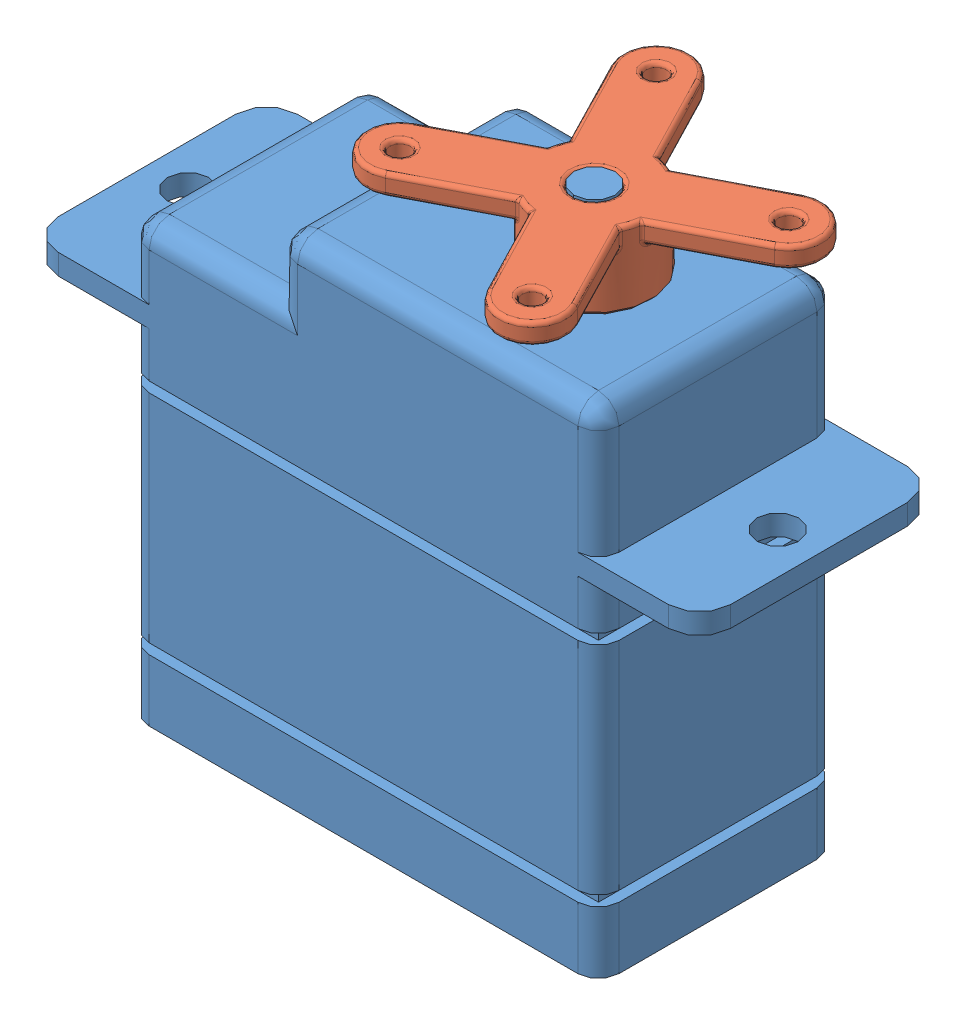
SolidWorks assembly Servo HS55.SLDASM, configuration Default (file format 3100). Lengths in mm.
Overall size (33.32 27.82 23.24).
2 component instances, 2 part files, 2 mates.
Components (placement in the parent):
- Servo HS-55-1: Servo HS-55.SLDPRT [Default] at (-7.9537 -3.3773 6.4916) size (32.6 27.8 11.6)
- Kreuz-1: Kreuz.SLDPRT [Default] at (8.8463 23.4227 12.2916) x (-0.458533 0 -0.888677) z (0.888677 0 -0.458533) size (17.25 3.72 17.25)
Mates (geometry in assembly coordinates):
- Konzentrisch1: concentric: cylinder of Servo HS-55-1; cylinder of Kreuz-1
- Deckungsgleich1: coincident aligned: plane of Servo HS-55-1 through (-11.3537 24.4227 7.9916) normal (0 1 0); plane of Kreuz-1 through (1.8467 24.4227 12.2134) normal (0 1 0)
